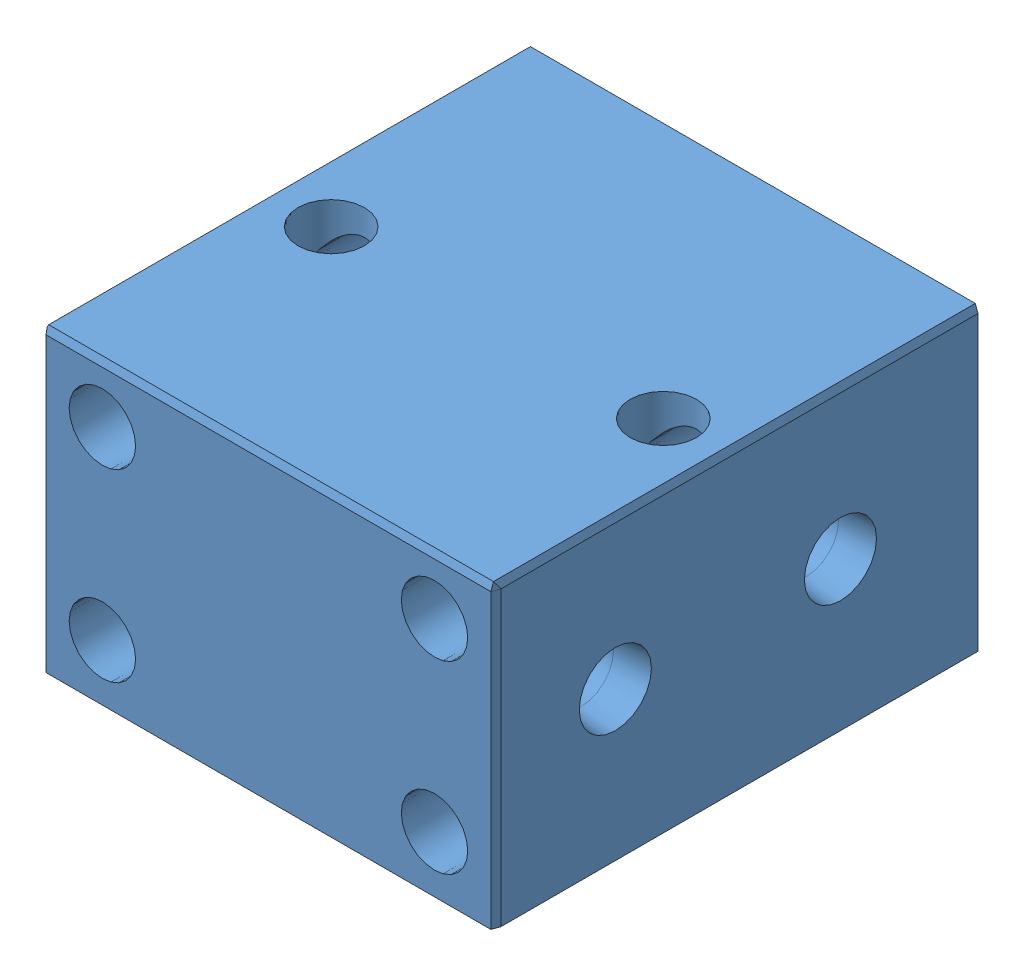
SolidWorks assembly Assem15.sldasm, configuration Default (file format 12000). Lengths in mm.
Overall size (61 41 76).
2 component instances, 2 part files, 2 mates.
Components (placement in the parent):
- BODY-1: BODY.SLDPRT [Default] at origin size (61 41 66)
- PISTON-2: PISTON.SLDPRT [Default] at (0 0 43) x (-0.899688 -0.436534 0) z (0 0 -1) size (12 12 53)
Mates (geometry in assembly coordinates):
- Concentric3: concentric: cylinder of BODY-1 through (0 0 50) axis (0 0 -1) radius 6; cylinder of PISTON-2 through (0 0 -3.1956) axis (0 0 1) radius 6
- Distance3: distance = 10 mm aligned: plane of PISTON-2 through (0 0 -10) normal (0 0 -1); plane of BODY-1 through (0 0 0) normal (0 0 -1)
